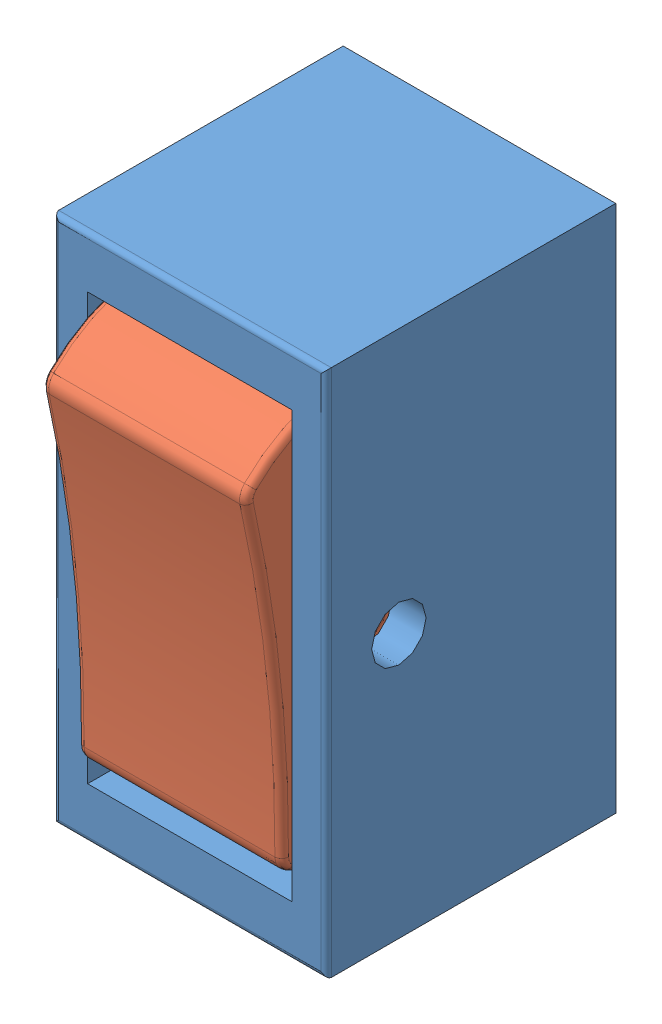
SolidWorks assembly BAlim_Inter.SLDASM, configuration Défaut (file format 13000). Lengths in mm.
Overall size (16 31 19.98).
2 component instances, 2 part files, 2 mates.
Components (placement in the parent):
- BAlim_CorpsInter-1: BAlim_CorpsInter.SLDPRT [Défaut] at (-34.4108 -0.7376 -8.5) size (16 31 17)
- BAlim_Inter-1: BAlim_Inter.SLDPRT [Défaut] at (-32.4108 1.7879 8.8603) x (0 0.107795 -0.994173) z (1 0 0) size (11.95 24.8 12)
Mates (geometry in assembly coordinates):
- Coïncidente1: coincident anti-aligned: plane of BAlim_CorpsInter-1 through (-20.4108 2.2624 8.5) normal (-1 0 0); plane of BAlim_Inter-1 through (-20.4108 23.826 10.1887) normal (1 0 0)
- Coaxiale1: concentric anti-aligned: cylinder of BAlim_CorpsInter-1 through (-34.4108 14.7624 4.232) axis (1 0 0) radius 1.5977; cylinder of BAlim_Inter-1 through (-20.4108 14.7624 4.232) axis (-1 0 0) radius 1
